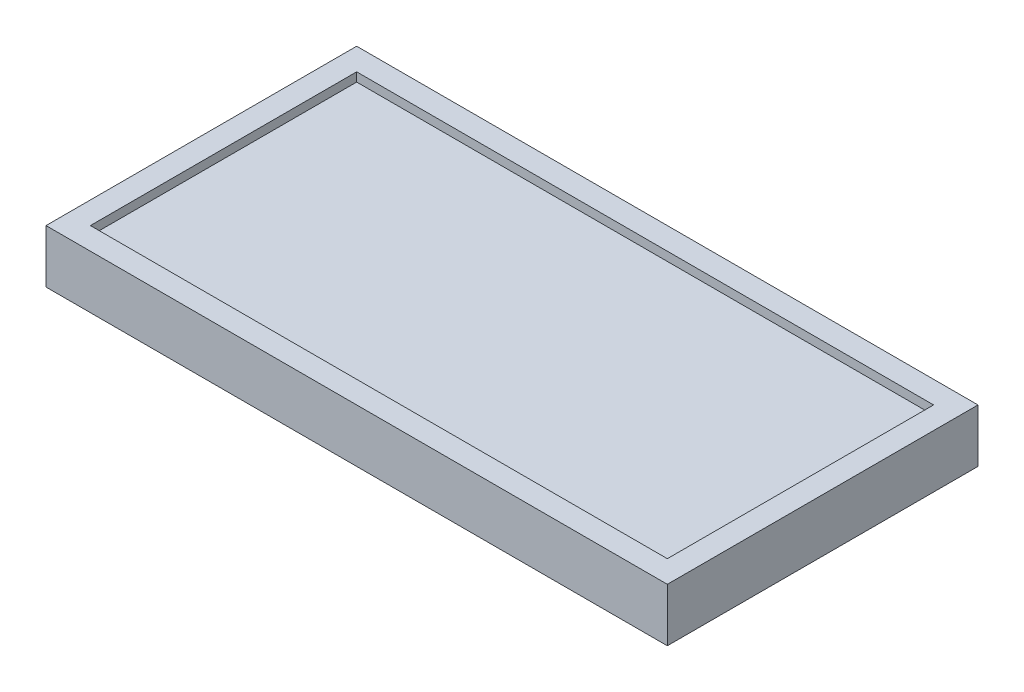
from build123d import *

# Parameters (mm, degrees)
SKETCH1_W           = 177.8
SKETCH1_H           = 88.9
BOSS_EXTRUDE1_DEPTH = 12.7
SKETCH2_W           = 177.8
SKETCH2_H           = 88.9
SKETCH2_W_2         = 165.1
SKETCH2_H_2         = 76.2
BOSS_EXTRUDE2_DEPTH = 2.54


with BuildPart() as part:
    # Sketch1 → Boss-Extrude1 (new body)
    with BuildSketch(Plane(origin=(0, 0, 0), x_dir=(1, 0, 0), z_dir=(0, 1, 0))):
        with Locations((88.9, 44.45)):
            Rectangle(SKETCH1_W, SKETCH1_H)
    extrude(amount=BOSS_EXTRUDE1_DEPTH)

    # Sketch2 → Boss-Extrude2 (add)
    with BuildSketch(Plane(origin=(0, 12.7, 0), x_dir=(1, 0, 0), z_dir=(0, 1, 0))):
        with Locations((88.9, 44.45)):
            Rectangle(SKETCH2_W, SKETCH2_H)
        with Locations((88.9, 44.45)):
            Rectangle(SKETCH2_W_2, SKETCH2_H_2, mode=Mode.SUBTRACT)
    extrude(amount=BOSS_EXTRUDE2_DEPTH)


solid = part.part
